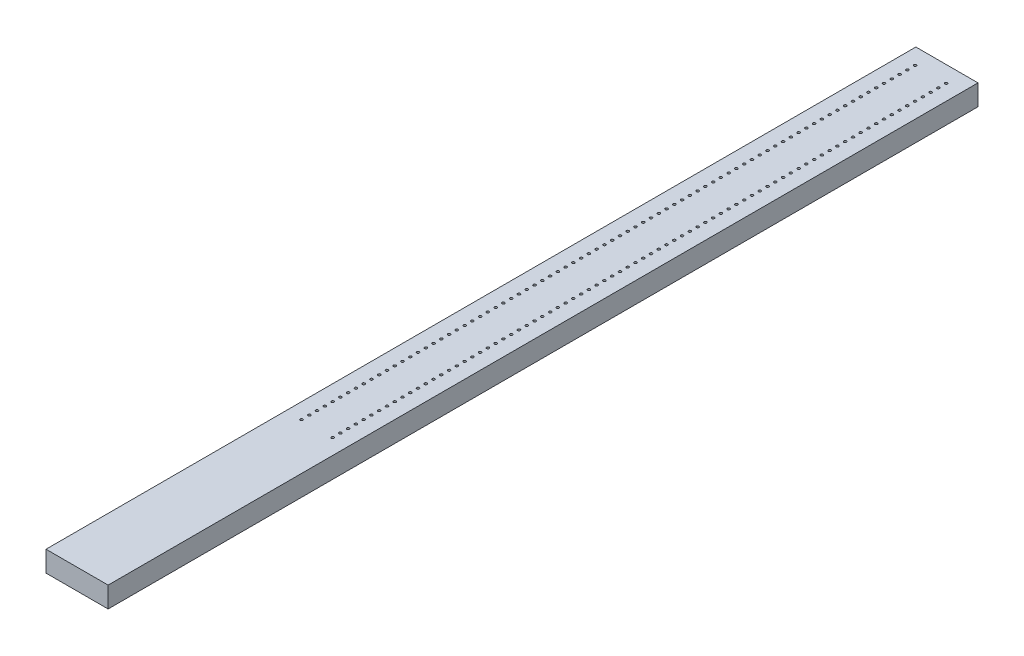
from build123d import *

# Parameters (mm, degrees)
SKETCH2_W           = 152.4
SKETCH2_H           = 50.8
BOSS_EXTRUDE1_DEPTH = 2133.6
SKETCH3_R           = 3.175
CUT_EXTRUDE1_DEPTH  = 19.05


with BuildPart() as part:
    # Sketch2 → Boss-Extrude1 (new body)
    with BuildSketch(Plane.XY):
        with Locations((12.353005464, 8.050273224)):
            Rectangle(SKETCH2_W, SKETCH2_H)
    extrude(amount=BOSS_EXTRUDE1_DEPTH)

    # Sketch3 → Cut-Extrude1 (cut)
    with BuildSketch(Plane(origin=(0, 33.450273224, 0), x_dir=(1, 0, 0), z_dir=(0, 1, 0))):
        with Locations(Location((-25.746994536, -39.998921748, 0), (0, 0, 270))):
            Circle(SKETCH3_R)
        with Locations(Location((50.453005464, -39.998921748, 0), (0, 0, 270))):
            Circle(SKETCH3_R)
        with Locations(Location((-25.746994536, -59.048921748, 0), (0, 0, 270))):
            Circle(SKETCH3_R)
        with Locations(Location((50.453005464, -59.048921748, 0), (0, 0, 270))):
            Circle(SKETCH3_R)
        with Locations(Location((-25.746994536, -78.098921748, 0), (0, 0, 270))):
            Circle(SKETCH3_R)
        with Locations(Location((50.453005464, -78.098921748, 0), (0, 0, 270))):
            Circle(SKETCH3_R)
        with Locations(Location((-25.746994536, -97.148921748, 0), (0, 0, 270))):
            Circle(SKETCH3_R)
        with Locations(Location((50.453005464, -97.148921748, 0), (0, 0, 270))):
            Circle(SKETCH3_R)
        with Locations(Location((-25.746994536, -116.198921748, 0), (0, 0, 270))):
            Circle(SKETCH3_R)
        with Locations(Location((50.453005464, -116.198921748, 0), (0, 0, 270))):
            Circle(SKETCH3_R)
        with Locations(Location((-25.746994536, -135.248921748, 0), (0, 0, 270))):
            Circle(SKETCH3_R)
        with Locations(Location((50.453005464, -135.248921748, 0), (0, 0, 270))):
            Circle(SKETCH3_R)
        with Locations(Location((-25.746994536, -154.298921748, 0), (0, 0, 270))):
            Circle(SKETCH3_R)
        with Locations(Location((50.453005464, -154.298921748, 0), (0, 0, 270))):
            Circle(SKETCH3_R)
        with Locations(Location((-25.746994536, -173.348921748, 0), (0, 0, 270))):
            Circle(SKETCH3_R)
        with Locations(Location((50.453005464, -173.348921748, 0), (0, 0, 270))):
            Circle(SKETCH3_R)
        with Locations(Location((-25.746994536, -192.398921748, 0), (0, 0, 270))):
            Circle(SKETCH3_R)
        with Locations(Location((50.453005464, -192.398921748, 0), (0, 0, 270))):
            Circle(SKETCH3_R)
        with Locations(Location((-25.746994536, -211.448921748, 0), (0, 0, 270))):
            Circle(SKETCH3_R)
        with Locations(Location((50.453005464, -211.448921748, 0), (0, 0, 270))):
            Circle(SKETCH3_R)
        with Locations(Location((-25.746994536, -230.498921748, 0), (0, 0, 270))):
            Circle(SKETCH3_R)
        with Locations(Location((50.453005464, -230.498921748, 0), (0, 0, 270))):
            Circle(SKETCH3_R)
        with Locations(Location((-25.746994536, -249.548921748, 0), (0, 0, 270))):
            Circle(SKETCH3_R)
        with Locations(Location((50.453005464, -249.548921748, 0), (0, 0, 270))):
            Circle(SKETCH3_R)
        with Locations(Location((-25.746994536, -268.598921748, 0), (0, 0, 270))):
            Circle(SKETCH3_R)
        with Locations(Location((50.453005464, -268.598921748, 0), (0, 0, 270))):
            Circle(SKETCH3_R)
        with Locations(Location((-25.746994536, -287.648921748, 0), (0, 0, 270))):
            Circle(SKETCH3_R)
        with Locations(Location((50.453005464, -287.648921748, 0), (0, 0, 270))):
            Circle(SKETCH3_R)
        with Locations(Location((-25.746994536, -306.698921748, 0), (0, 0, 270))):
            Circle(SKETCH3_R)
        with Locations(Location((50.453005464, -306.698921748, 0), (0, 0, 270))):
            Circle(SKETCH3_R)
        with Locations(Location((-25.746994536, -325.748921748, 0), (0, 0, 270))):
            Circle(SKETCH3_R)
        with Locations(Location((50.453005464, -325.748921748, 0), (0, 0, 270))):
            Circle(SKETCH3_R)
        with Locations(Location((-25.746994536, -344.798921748, 0), (0, 0, 270))):
            Circle(SKETCH3_R)
        with Locations(Location((50.453005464, -344.798921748, 0), (0, 0, 270))):
            Circle(SKETCH3_R)
        with Locations(Location((-25.746994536, -363.848921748, 0), (0, 0, 270))):
            Circle(SKETCH3_R)
        with Locations(Location((50.453005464, -363.848921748, 0), (0, 0, 270))):
            Circle(SKETCH3_R)
        with Locations(Location((-25.746994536, -382.898921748, 0), (0, 0, 270))):
            Circle(SKETCH3_R)
        with Locations(Location((50.453005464, -382.898921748, 0), (0, 0, 270))):
            Circle(SKETCH3_R)
        with Locations(Location((-25.746994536, -401.948921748, 0), (0, 0, 270))):
            Circle(SKETCH3_R)
        with Locations(Location((50.453005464, -401.948921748, 0), (0, 0, 270))):
            Circle(SKETCH3_R)
        with Locations(Location((-25.746994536, -420.998921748, 0), (0, 0, 270))):
            Circle(SKETCH3_R)
        with Locations(Location((50.453005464, -420.998921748, 0), (0, 0, 270))):
            Circle(SKETCH3_R)
        with Locations(Location((-25.746994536, -440.048921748, 0), (0, 0, 270))):
            Circle(SKETCH3_R)
        with Locations(Location((50.453005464, -440.048921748, 0), (0, 0, 270))):
            Circle(SKETCH3_R)
        with Locations(Location((-25.746994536, -459.098921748, 0), (0, 0, 270))):
            Circle(SKETCH3_R)
        with Locations(Location((50.453005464, -459.098921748, 0), (0, 0, 270))):
            Circle(SKETCH3_R)
        with Locations(Location((-25.746994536, -478.148921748, 0), (0, 0, 270))):
            Circle(SKETCH3_R)
        with Locations(Location((50.453005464, -478.148921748, 0), (0, 0, 270))):
            Circle(SKETCH3_R)
        with Locations(Location((-25.746994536, -497.198921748, 0), (0, 0, 270))):
            Circle(SKETCH3_R)
        with Locations(Location((50.453005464, -497.198921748, 0), (0, 0, 270))):
            Circle(SKETCH3_R)
        with Locations(Location((-25.746994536, -516.248921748, 0), (0, 0, 270))):
            Circle(SKETCH3_R)
        with Locations(Location((50.453005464, -516.248921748, 0), (0, 0, 270))):
            Circle(SKETCH3_R)
        with Locations(Location((-25.746994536, -535.298921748, 0), (0, 0, 270))):
            Circle(SKETCH3_R)
        with Locations(Location((50.453005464, -535.298921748, 0), (0, 0, 270))):
            Circle(SKETCH3_R)
        with Locations(Location((-25.746994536, -554.348921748, 0), (0, 0, 270))):
            Circle(SKETCH3_R)
        with Locations(Location((50.453005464, -554.348921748, 0), (0, 0, 270))):
            Circle(SKETCH3_R)
        with Locations(Location((-25.746994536, -573.398921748, 0), (0, 0, 270))):
            Circle(SKETCH3_R)
        with Locations(Location((50.453005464, -573.398921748, 0), (0, 0, 270))):
            Circle(SKETCH3_R)
        with Locations(Location((-25.746994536, -592.448921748, 0), (0, 0, 270))):
            Circle(SKETCH3_R)
        with Locations(Location((50.453005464, -592.448921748, 0), (0, 0, 270))):
            Circle(SKETCH3_R)
        with Locations(Location((-25.746994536, -611.498921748, 0), (0, 0, 270))):
            Circle(SKETCH3_R)
        with Locations(Location((50.453005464, -611.498921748, 0), (0, 0, 270))):
            Circle(SKETCH3_R)
        with Locations(Location((-25.746994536, -630.548921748, 0), (0, 0, 270))):
            Circle(SKETCH3_R)
        with Locations(Location((50.453005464, -630.548921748, 0), (0, 0, 270))):
            Circle(SKETCH3_R)
        with Locations(Location((-25.746994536, -649.598921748, 0), (0, 0, 270))):
            Circle(SKETCH3_R)
        with Locations(Location((50.453005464, -649.598921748, 0), (0, 0, 270))):
            Circle(SKETCH3_R)
        with Locations(Location((-25.746994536, -668.648921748, 0), (0, 0, 270))):
            Circle(SKETCH3_R)
        with Locations(Location((50.453005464, -668.648921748, 0), (0, 0, 270))):
            Circle(SKETCH3_R)
        with Locations(Location((-25.746994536, -687.698921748, 0), (0, 0, 270))):
            Circle(SKETCH3_R)
        with Locations(Location((50.453005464, -687.698921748, 0), (0, 0, 270))):
            Circle(SKETCH3_R)
        with Locations(Location((-25.746994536, -706.748921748, 0), (0, 0, 270))):
            Circle(SKETCH3_R)
        with Locations(Location((50.453005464, -706.748921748, 0), (0, 0, 270))):
            Circle(SKETCH3_R)
        with Locations(Location((-25.746994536, -725.798921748, 0), (0, 0, 270))):
            Circle(SKETCH3_R)
        with Locations(Location((50.453005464, -725.798921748, 0), (0, 0, 270))):
            Circle(SKETCH3_R)
        with Locations(Location((-25.746994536, -744.848921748, 0), (0, 0, 270))):
            Circle(SKETCH3_R)
        with Locations(Location((50.453005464, -744.848921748, 0), (0, 0, 270))):
            Circle(SKETCH3_R)
        with Locations(Location((-25.746994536, -763.898921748, 0), (0, 0, 270))):
            Circle(SKETCH3_R)
        with Locations(Location((50.453005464, -763.898921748, 0), (0, 0, 270))):
            Circle(SKETCH3_R)
        with Locations(Location((-25.746994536, -782.948921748, 0), (0, 0, 270))):
            Circle(SKETCH3_R)
        with Locations(Location((50.453005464, -782.948921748, 0), (0, 0, 270))):
            Circle(SKETCH3_R)
        with Locations(Location((-25.746994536, -801.998921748, 0), (0, 0, 270))):
            Circle(SKETCH3_R)
        with Locations(Location((50.453005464, -801.998921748, 0), (0, 0, 270))):
            Circle(SKETCH3_R)
        with Locations(Location((-25.746994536, -821.048921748, 0), (0, 0, 270))):
            Circle(SKETCH3_R)
        with Locations(Location((50.453005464, -821.048921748, 0), (0, 0, 270))):
            Circle(SKETCH3_R)
        with Locations(Location((-25.746994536, -840.098921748, 0), (0, 0, 270))):
            Circle(SKETCH3_R)
        with Locations(Location((50.453005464, -840.098921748, 0), (0, 0, 270))):
            Circle(SKETCH3_R)
        with Locations(Location((-25.746994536, -859.148921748, 0), (0, 0, 270))):
            Circle(SKETCH3_R)
        with Locations(Location((50.453005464, -859.148921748, 0), (0, 0, 270))):
            Circle(SKETCH3_R)
        with Locations(Location((-25.746994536, -878.198921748, 0), (0, 0, 270))):
            Circle(SKETCH3_R)
        with Locations(Location((50.453005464, -878.198921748, 0), (0, 0, 270))):
            Circle(SKETCH3_R)
        with Locations(Location((-25.746994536, -897.248921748, 0), (0, 0, 270))):
            Circle(SKETCH3_R)
        with Locations(Location((50.453005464, -897.248921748, 0), (0, 0, 270))):
            Circle(SKETCH3_R)
        with Locations(Location((-25.746994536, -916.298921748, 0), (0, 0, 270))):
            Circle(SKETCH3_R)
        with Locations(Location((50.453005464, -916.298921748, 0), (0, 0, 270))):
            Circle(SKETCH3_R)
        with Locations(Location((-25.746994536, -935.348921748, 0), (0, 0, 270))):
            Circle(SKETCH3_R)
        with Locations(Location((50.453005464, -935.348921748, 0), (0, 0, 270))):
            Circle(SKETCH3_R)
        with Locations(Location((-25.746994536, -954.398921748, 0), (0, 0, 270))):
            Circle(SKETCH3_R)
        with Locations(Location((50.453005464, -954.398921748, 0), (0, 0, 270))):
            Circle(SKETCH3_R)
        with Locations(Location((-25.746994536, -973.448921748, 0), (0, 0, 270))):
            Circle(SKETCH3_R)
        with Locations(Location((50.453005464, -973.448921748, 0), (0, 0, 270))):
            Circle(SKETCH3_R)
        with Locations(Location((-25.746994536, -992.498921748, 0), (0, 0, 270))):
            Circle(SKETCH3_R)
        with Locations(Location((50.453005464, -992.498921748, 0), (0, 0, 270))):
            Circle(SKETCH3_R)
        with Locations(Location((-25.746994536, -1011.548921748, 0), (0, 0, 270))):
            Circle(SKETCH3_R)
        with Locations(Location((50.453005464, -1011.548921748, 0), (0, 0, 270))):
            Circle(SKETCH3_R)
        with Locations(Location((-25.746994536, -1030.598921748, 0), (0, 0, 270))):
            Circle(SKETCH3_R)
        with Locations(Location((50.453005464, -1030.598921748, 0), (0, 0, 270))):
            Circle(SKETCH3_R)
        with Locations(Location((-25.746994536, -1049.648921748, 0), (0, 0, 270))):
            Circle(SKETCH3_R)
        with Locations(Location((50.453005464, -1049.648921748, 0), (0, 0, 270))):
            Circle(SKETCH3_R)
        with Locations(Location((-25.746994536, -1068.698921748, 0), (0, 0, 270))):
            Circle(SKETCH3_R)
        with Locations(Location((50.453005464, -1068.698921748, 0), (0, 0, 270))):
            Circle(SKETCH3_R)
        with Locations(Location((-25.746994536, -1087.748921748, 0), (0, 0, 270))):
            Circle(SKETCH3_R)
        with Locations(Location((50.453005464, -1087.748921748, 0), (0, 0, 270))):
            Circle(SKETCH3_R)
        with Locations(Location((-25.746994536, -1106.798921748, 0), (0, 0, 270))):
            Circle(SKETCH3_R)
        with Locations(Location((50.453005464, -1106.798921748, 0), (0, 0, 270))):
            Circle(SKETCH3_R)
        with Locations(Location((-25.746994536, -1125.848921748, 0), (0, 0, 270))):
            Circle(SKETCH3_R)
        with Locations(Location((50.453005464, -1125.848921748, 0), (0, 0, 270))):
            Circle(SKETCH3_R)
        with Locations(Location((-25.746994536, -1144.898921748, 0), (0, 0, 270))):
            Circle(SKETCH3_R)
        with Locations(Location((50.453005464, -1144.898921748, 0), (0, 0, 270))):
            Circle(SKETCH3_R)
        with Locations(Location((-25.746994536, -1163.948921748, 0), (0, 0, 270))):
            Circle(SKETCH3_R)
        with Locations(Location((50.453005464, -1163.948921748, 0), (0, 0, 270))):
            Circle(SKETCH3_R)
        with Locations(Location((-25.746994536, -1182.998921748, 0), (0, 0, 270))):
            Circle(SKETCH3_R)
        with Locations(Location((50.453005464, -1182.998921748, 0), (0, 0, 270))):
            Circle(SKETCH3_R)
        with Locations(Location((-25.746994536, -1202.048921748, 0), (0, 0, 270))):
            Circle(SKETCH3_R)
        with Locations(Location((50.453005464, -1202.048921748, 0), (0, 0, 270))):
            Circle(SKETCH3_R)
        with Locations(Location((-25.746994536, -1221.098921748, 0), (0, 0, 270))):
            Circle(SKETCH3_R)
        with Locations(Location((50.453005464, -1221.098921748, 0), (0, 0, 270))):
            Circle(SKETCH3_R)
        with Locations(Location((-25.746994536, -1240.148921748, 0), (0, 0, 270))):
            Circle(SKETCH3_R)
        with Locations(Location((50.453005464, -1240.148921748, 0), (0, 0, 270))):
            Circle(SKETCH3_R)
        with Locations(Location((-25.746994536, -1259.198921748, 0), (0, 0, 270))):
            Circle(SKETCH3_R)
        with Locations(Location((50.453005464, -1259.198921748, 0), (0, 0, 270))):
            Circle(SKETCH3_R)
        with Locations(Location((-25.746994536, -1278.248921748, 0), (0, 0, 270))):
            Circle(SKETCH3_R)
        with Locations(Location((50.453005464, -1278.248921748, 0), (0, 0, 270))):
            Circle(SKETCH3_R)
        with Locations(Location((-25.746994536, -1297.298921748, 0), (0, 0, 270))):
            Circle(SKETCH3_R)
        with Locations(Location((50.453005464, -1297.298921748, 0), (0, 0, 270))):
            Circle(SKETCH3_R)
        with Locations(Location((-25.746994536, -1316.348921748, 0), (0, 0, 270))):
            Circle(SKETCH3_R)
        with Locations(Location((50.453005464, -1316.348921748, 0), (0, 0, 270))):
            Circle(SKETCH3_R)
        with Locations(Location((-25.746994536, -1335.398921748, 0), (0, 0, 270))):
            Circle(SKETCH3_R)
        with Locations(Location((50.453005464, -1335.398921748, 0), (0, 0, 270))):
            Circle(SKETCH3_R)
        with Locations(Location((-25.746994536, -1354.448921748, 0), (0, 0, 270))):
            Circle(SKETCH3_R)
        with Locations(Location((50.453005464, -1354.448921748, 0), (0, 0, 270))):
            Circle(SKETCH3_R)
        with Locations(Location((-25.746994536, -1373.498921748, 0), (0, 0, 270))):
            Circle(SKETCH3_R)
        with Locations(Location((50.453005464, -1373.498921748, 0), (0, 0, 270))):
            Circle(SKETCH3_R)
        with Locations(Location((-25.746994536, -1392.548921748, 0), (0, 0, 270))):
            Circle(SKETCH3_R)
        with Locations(Location((50.453005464, -1392.548921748, 0), (0, 0, 270))):
            Circle(SKETCH3_R)
        with Locations(Location((-25.746994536, -1411.598921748, 0), (0, 0, 270))):
            Circle(SKETCH3_R)
        with Locations(Location((50.453005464, -1411.598921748, 0), (0, 0, 270))):
            Circle(SKETCH3_R)
        with Locations(Location((-25.746994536, -1430.648921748, 0), (0, 0, 270))):
            Circle(SKETCH3_R)
        with Locations(Location((50.453005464, -1430.648921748, 0), (0, 0, 270))):
            Circle(SKETCH3_R)
        with Locations(Location((-25.746994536, -1449.698921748, 0), (0, 0, 270))):
            Circle(SKETCH3_R)
        with Locations(Location((50.453005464, -1449.698921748, 0), (0, 0, 270))):
            Circle(SKETCH3_R)
        with Locations(Location((-25.746994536, -1468.748921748, 0), (0, 0, 270))):
            Circle(SKETCH3_R)
        with Locations(Location((50.453005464, -1468.748921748, 0), (0, 0, 270))):
            Circle(SKETCH3_R)
        with Locations(Location((-25.746994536, -1487.798921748, 0), (0, 0, 270))):
            Circle(SKETCH3_R)
        with Locations(Location((50.453005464, -1487.798921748, 0), (0, 0, 270))):
            Circle(SKETCH3_R)
        with Locations(Location((-25.746994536, -1506.848921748, 0), (0, 0, 270))):
            Circle(SKETCH3_R)
        with Locations(Location((50.453005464, -1506.848921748, 0), (0, 0, 270))):
            Circle(SKETCH3_R)
        with Locations(Location((-25.746994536, -1525.898921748, 0), (0, 0, 270))):
            Circle(SKETCH3_R)
        with Locations(Location((50.453005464, -1525.898921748, 0), (0, 0, 270))):
            Circle(SKETCH3_R)
        with Locations(Location((-25.746994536, -1544.948921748, 0), (0, 0, 270))):
            Circle(SKETCH3_R)
        with Locations(Location((50.453005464, -1544.948921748, 0), (0, 0, 270))):
            Circle(SKETCH3_R)
    extrude(amount=-CUT_EXTRUDE1_DEPTH, mode=Mode.SUBTRACT)


solid = part.part
